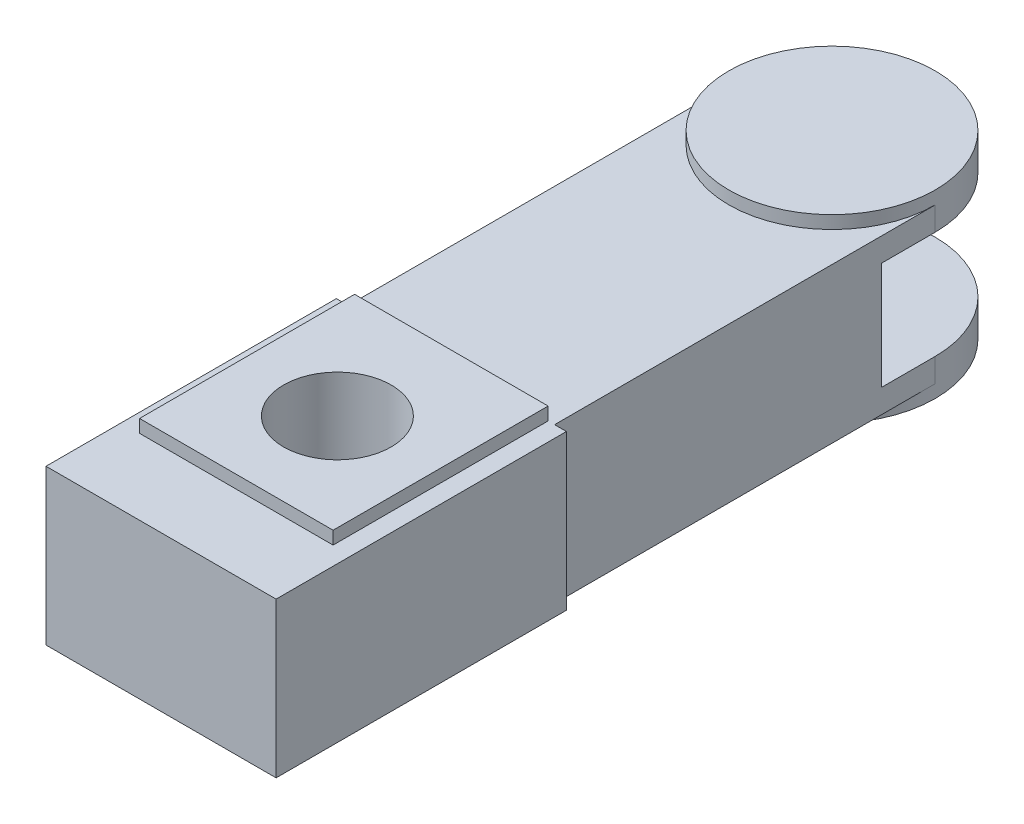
ISO-10303-21;
HEADER;
FILE_DESCRIPTION(('STEP AP214'),'2;1');
FILE_NAME('part.step','',(''),(''),'','','');
FILE_SCHEMA(('AUTOMOTIVE_DESIGN { 1 0 10303 214 1 1 1 1 }'));
ENDSEC;
DATA;
#1=APPLICATION_CONTEXT('core data for automotive mechanical design processes');
#2=APPLICATION_PROTOCOL_DEFINITION('international standard','automotive_design',2000,#1);
#3=PRODUCT_CONTEXT('',#1,'mechanical');
#4=PRODUCT('Part','Part','',(#3));
#5=PRODUCT_RELATED_PRODUCT_CATEGORY('part','',(#4));
#6=PRODUCT_DEFINITION_FORMATION('','',#4);
#7=PRODUCT_DEFINITION_CONTEXT('part definition',#1,'design');
#8=PRODUCT_DEFINITION('design','',#6,#7);
#9=PRODUCT_DEFINITION_SHAPE('','',#8);
#10=(LENGTH_UNIT() NAMED_UNIT(*) SI_UNIT(.MILLI.,.METRE.));
#11=(NAMED_UNIT(*) PLANE_ANGLE_UNIT() SI_UNIT($,.RADIAN.));
#12=(NAMED_UNIT(*) SI_UNIT($,.STERADIAN.) SOLID_ANGLE_UNIT());
#13=UNCERTAINTY_MEASURE_WITH_UNIT(LENGTH_MEASURE(1.E-05),#10,'distance_accuracy_value','');
#14=(GEOMETRIC_REPRESENTATION_CONTEXT(3) GLOBAL_UNCERTAINTY_ASSIGNED_CONTEXT((#13)) GLOBAL_UNIT_ASSIGNED_CONTEXT((#10,
#11,#12)) REPRESENTATION_CONTEXT('',''));
#15=CARTESIAN_POINT('',(0.,0.,0.));
#16=DIRECTION('',(0.,0.,1.));
#17=DIRECTION('',(1.,0.,0.));
#18=AXIS2_PLACEMENT_3D('',#15,#16,#17);
#19=CARTESIAN_POINT('',(0.,36.,-312.));
#20=DIRECTION('',(0.,-1.,0.));
#21=DIRECTION('',(0.,0.,-1.));
#22=AXIS2_PLACEMENT_3D('',#19,#20,#21);
#23=CYLINDRICAL_SURFACE('',#22,48.);
#24=CARTESIAN_POINT('',(0.,-42.,-312.));
#25=DIRECTION('',(0.,1.,0.));
#26=DIRECTION('',(0.,0.,1.));
#27=AXIS2_PLACEMENT_3D('',#24,#25,#26);
#28=CIRCLE('',#27,48.);
#29=CARTESIAN_POINT('',(0.,-42.,-264.));
#30=VERTEX_POINT('',#29);
#31=EDGE_CURVE('E259',#30,#30,#28,.T.);
#32=ORIENTED_EDGE('',*,*,#31,.T.);
#33=EDGE_LOOP('',(#32));
#34=FACE_BOUND('',#33,.T.);
#35=CARTESIAN_POINT('',(0.,-25.,-312.));
#36=DIRECTION('',(0.,1.,0.));
#37=DIRECTION('',(0.,0.,1.));
#38=AXIS2_PLACEMENT_3D('',#35,#36,#37);
#39=CIRCLE('',#38,48.);
#40=CARTESIAN_POINT('',(48.,-25.,-312.));
#41=VERTEX_POINT('',#40);
#42=CARTESIAN_POINT('',(-48.,-25.,-312.));
#43=VERTEX_POINT('',#42);
#44=EDGE_CURVE('E338',#41,#43,#39,.T.);
#45=ORIENTED_EDGE('',*,*,#44,.F.);
#46=DIRECTION('',(0.,-1.,0.));
#47=VECTOR('',#46,1.);
#48=CARTESIAN_POINT('',(48.,36.,-312.));
#49=LINE('',#48,#47);
#50=CARTESIAN_POINT('',(48.,-36.,-312.));
#51=VERTEX_POINT('',#50);
#52=EDGE_CURVE('E207',#41,#51,#49,.T.);
#53=ORIENTED_EDGE('',*,*,#52,.T.);
#54=CARTESIAN_POINT('',(0.,-36.,-312.));
#55=DIRECTION('',(0.,1.,0.));
#56=DIRECTION('',(0.,0.,1.));
#57=AXIS2_PLACEMENT_3D('',#54,#55,#56);
#58=CIRCLE('',#57,48.);
#59=CARTESIAN_POINT('',(-48.,-36.,-312.));
#60=VERTEX_POINT('',#59);
#61=EDGE_CURVE('E210',#51,#60,#58,.F.);
#62=ORIENTED_EDGE('',*,*,#61,.T.);
#63=DIRECTION('',(0.,-1.,0.));
#64=VECTOR('',#63,1.);
#65=CARTESIAN_POINT('',(-48.,36.,-312.));
#66=LINE('',#65,#64);
#67=EDGE_CURVE('E310',#43,#60,#66,.T.);
#68=ORIENTED_EDGE('',*,*,#67,.F.);
#69=EDGE_LOOP('',(#45,#53,#62,#68));
#70=FACE_BOUND('',#69,.T.);
#71=ADVANCED_FACE('F28',(#34,#70),#23,.T.);
#72=CARTESIAN_POINT('',(0.,36.,-312.));
#73=DIRECTION('',(0.,1.,0.));
#74=DIRECTION('',(0.,0.,1.));
#75=AXIS2_PLACEMENT_3D('',#72,#73,#74);
#76=PLANE('',#75);
#77=DIRECTION('',(0.,0.,-1.));
#78=VECTOR('',#77,1.);
#79=CARTESIAN_POINT('',(48.,36.,-135.));
#80=LINE('',#79,#78);
#81=CARTESIAN_POINT('',(48.,36.,-135.));
#82=VERTEX_POINT('',#81);
#83=CARTESIAN_POINT('',(48.,36.,-312.));
#84=VERTEX_POINT('',#83);
#85=EDGE_CURVE('E285',#82,#84,#80,.T.);
#86=ORIENTED_EDGE('',*,*,#85,.T.);
#87=CARTESIAN_POINT('',(0.,36.,-312.));
#88=DIRECTION('',(0.,1.,0.));
#89=DIRECTION('',(0.,0.,1.));
#90=AXIS2_PLACEMENT_3D('',#87,#88,#89);
#91=CIRCLE('',#90,48.);
#92=CARTESIAN_POINT('',(-48.,36.,-312.));
#93=VERTEX_POINT('',#92);
#94=EDGE_CURVE('E204',#84,#93,#91,.F.);
#95=ORIENTED_EDGE('',*,*,#94,.T.);
#96=DIRECTION('',(0.,0.,1.));
#97=VECTOR('',#96,1.);
#98=CARTESIAN_POINT('',(-48.,36.,-312.));
#99=LINE('',#98,#97);
#100=CARTESIAN_POINT('',(-48.,36.,-135.));
#101=VERTEX_POINT('',#100);
#102=EDGE_CURVE('E287',#93,#101,#99,.T.);
#103=ORIENTED_EDGE('',*,*,#102,.T.);
#104=DIRECTION('',(-1.,0.,0.));
#105=VECTOR('',#104,1.);
#106=CARTESIAN_POINT('',(-53.5,36.,-135.));
#107=LINE('',#106,#105);
#108=CARTESIAN_POINT('',(-53.5,36.,-135.));
#109=VERTEX_POINT('',#108);
#110=EDGE_CURVE('E289',#101,#109,#107,.T.);
#111=ORIENTED_EDGE('',*,*,#110,.T.);
#112=DIRECTION('',(0.,0.,1.));
#113=VECTOR('',#112,1.);
#114=CARTESIAN_POINT('',(-53.5,36.,0.));
#115=LINE('',#114,#113);
#116=CARTESIAN_POINT('',(-53.5,36.,0.));
#117=VERTEX_POINT('',#116);
#118=EDGE_CURVE('E291',#109,#117,#115,.T.);
#119=ORIENTED_EDGE('',*,*,#118,.T.);
#120=DIRECTION('',(1.,0.,0.));
#121=VECTOR('',#120,1.);
#122=CARTESIAN_POINT('',(-53.5,36.,0.));
#123=LINE('',#122,#121);
#124=CARTESIAN_POINT('',(53.5,36.,0.));
#125=VERTEX_POINT('',#124);
#126=EDGE_CURVE('E293',#117,#125,#123,.T.);
#127=ORIENTED_EDGE('',*,*,#126,.T.);
#128=DIRECTION('',(0.,0.,-1.));
#129=VECTOR('',#128,1.);
#130=CARTESIAN_POINT('',(53.5,36.,0.));
#131=LINE('',#130,#129);
#132=CARTESIAN_POINT('',(53.5,36.,-135.));
#133=VERTEX_POINT('',#132);
#134=EDGE_CURVE('E295',#125,#133,#131,.T.);
#135=ORIENTED_EDGE('',*,*,#134,.T.);
#136=DIRECTION('',(-1.,0.,0.));
#137=VECTOR('',#136,1.);
#138=CARTESIAN_POINT('',(53.5,36.,-135.));
#139=LINE('',#138,#137);
#140=EDGE_CURVE('E282',#133,#82,#139,.T.);
#141=ORIENTED_EDGE('',*,*,#140,.T.);
#142=EDGE_LOOP('',(#86,#95,#103,#111,#119,#127,#135,#141));
#143=FACE_BOUND('',#142,.T.);
#144=DIRECTION('',(-1.,0.,0.));
#145=VECTOR('',#144,1.);
#146=CARTESIAN_POINT('',(0.,36.,-35.));
#147=LINE('',#146,#145);
#148=CARTESIAN_POINT('',(45.,36.,-35.));
#149=VERTEX_POINT('',#148);
#150=CARTESIAN_POINT('',(-45.,36.,-35.));
#151=VERTEX_POINT('',#150);
#152=EDGE_CURVE('E253',#149,#151,#147,.T.);
#153=ORIENTED_EDGE('',*,*,#152,.T.);
#154=DIRECTION('',(0.,0.,-1.));
#155=VECTOR('',#154,1.);
#156=CARTESIAN_POINT('',(-45.,36.,-312.));
#157=LINE('',#156,#155);
#158=CARTESIAN_POINT('',(-45.,36.,-135.));
#159=VERTEX_POINT('',#158);
#160=EDGE_CURVE('E256',#151,#159,#157,.T.);
#161=ORIENTED_EDGE('',*,*,#160,.T.);
#162=DIRECTION('',(1.,0.,0.));
#163=VECTOR('',#162,1.);
#164=CARTESIAN_POINT('',(0.,36.,-135.));
#165=LINE('',#164,#163);
#166=CARTESIAN_POINT('',(45.,36.,-135.));
#167=VERTEX_POINT('',#166);
#168=EDGE_CURVE('E243',#159,#167,#165,.T.);
#169=ORIENTED_EDGE('',*,*,#168,.T.);
#170=DIRECTION('',(0.,0.,1.));
#171=VECTOR('',#170,1.);
#172=CARTESIAN_POINT('',(45.,36.,-312.));
#173=LINE('',#172,#171);
#174=EDGE_CURVE('E250',#167,#149,#173,.T.);
#175=ORIENTED_EDGE('',*,*,#174,.T.);
#176=EDGE_LOOP('',(#153,#161,#169,#175));
#177=FACE_BOUND('',#176,.T.);
#178=ADVANCED_FACE('F322',(#143,#177),#76,.T.);
#179=CARTESIAN_POINT('',(0.,-36.,-312.));
#180=DIRECTION('',(0.,1.,0.));
#181=DIRECTION('',(0.,0.,1.));
#182=AXIS2_PLACEMENT_3D('',#179,#180,#181);
#183=PLANE('',#182);
#184=ORIENTED_EDGE('',*,*,#61,.F.);
#185=DIRECTION('',(0.,0.,-1.));
#186=VECTOR('',#185,1.);
#187=CARTESIAN_POINT('',(48.,-36.,-135.));
#188=LINE('',#187,#186);
#189=CARTESIAN_POINT('',(48.,-36.,-135.));
#190=VERTEX_POINT('',#189);
#191=EDGE_CURVE('E269',#190,#51,#188,.T.);
#192=ORIENTED_EDGE('',*,*,#191,.F.);
#193=DIRECTION('',(-1.,0.,0.));
#194=VECTOR('',#193,1.);
#195=CARTESIAN_POINT('',(53.5,-36.,-135.));
#196=LINE('',#195,#194);
#197=CARTESIAN_POINT('',(53.5,-36.,-135.));
#198=VERTEX_POINT('',#197);
#199=EDGE_CURVE('E266',#198,#190,#196,.T.);
#200=ORIENTED_EDGE('',*,*,#199,.F.);
#201=DIRECTION('',(0.,0.,-1.));
#202=VECTOR('',#201,1.);
#203=CARTESIAN_POINT('',(53.5,-36.,0.));
#204=LINE('',#203,#202);
#205=CARTESIAN_POINT('',(53.5,-36.,0.));
#206=VERTEX_POINT('',#205);
#207=EDGE_CURVE('E280',#206,#198,#204,.T.);
#208=ORIENTED_EDGE('',*,*,#207,.F.);
#209=DIRECTION('',(1.,0.,0.));
#210=VECTOR('',#209,1.);
#211=CARTESIAN_POINT('',(-53.5,-36.,0.));
#212=LINE('',#211,#210);
#213=CARTESIAN_POINT('',(-53.5,-36.,0.));
#214=VERTEX_POINT('',#213);
#215=EDGE_CURVE('E278',#214,#206,#212,.T.);
#216=ORIENTED_EDGE('',*,*,#215,.F.);
#217=DIRECTION('',(0.,0.,1.));
#218=VECTOR('',#217,1.);
#219=CARTESIAN_POINT('',(-53.5,-36.,0.));
#220=LINE('',#219,#218);
#221=CARTESIAN_POINT('',(-53.5,-36.,-135.));
#222=VERTEX_POINT('',#221);
#223=EDGE_CURVE('E276',#222,#214,#220,.T.);
#224=ORIENTED_EDGE('',*,*,#223,.F.);
#225=DIRECTION('',(-1.,0.,0.));
#226=VECTOR('',#225,1.);
#227=CARTESIAN_POINT('',(-53.5,-36.,-135.));
#228=LINE('',#227,#226);
#229=CARTESIAN_POINT('',(-48.,-36.,-135.));
#230=VERTEX_POINT('',#229);
#231=EDGE_CURVE('E274',#230,#222,#228,.T.);
#232=ORIENTED_EDGE('',*,*,#231,.F.);
#233=DIRECTION('',(0.,0.,1.));
#234=VECTOR('',#233,1.);
#235=CARTESIAN_POINT('',(-48.,-36.,-312.));
#236=LINE('',#235,#234);
#237=EDGE_CURVE('E272',#60,#230,#236,.T.);
#238=ORIENTED_EDGE('',*,*,#237,.F.);
#239=EDGE_LOOP('',(#184,#192,#200,#208,#216,#224,#232,#238));
#240=FACE_BOUND('',#239,.T.);
#241=DIRECTION('',(0.,0.,-1.));
#242=VECTOR('',#241,1.);
#243=CARTESIAN_POINT('',(-45.,-36.,-312.));
#244=LINE('',#243,#242);
#245=CARTESIAN_POINT('',(-45.,-36.,-35.));
#246=VERTEX_POINT('',#245);
#247=CARTESIAN_POINT('',(-45.,-36.,-135.));
#248=VERTEX_POINT('',#247);
#249=EDGE_CURVE('E11',#246,#248,#244,.T.);
#250=ORIENTED_EDGE('',*,*,#249,.F.);
#251=DIRECTION('',(-1.,0.,0.));
#252=VECTOR('',#251,1.);
#253=CARTESIAN_POINT('',(0.,-36.,-35.));
#254=LINE('',#253,#252);
#255=CARTESIAN_POINT('',(45.,-36.,-35.));
#256=VERTEX_POINT('',#255);
#257=EDGE_CURVE('E36',#256,#246,#254,.T.);
#258=ORIENTED_EDGE('',*,*,#257,.F.);
#259=DIRECTION('',(0.,0.,1.));
#260=VECTOR('',#259,1.);
#261=CARTESIAN_POINT('',(45.,-36.,-312.));
#262=LINE('',#261,#260);
#263=CARTESIAN_POINT('',(45.,-36.,-135.));
#264=VERTEX_POINT('',#263);
#265=EDGE_CURVE('E221',#264,#256,#262,.T.);
#266=ORIENTED_EDGE('',*,*,#265,.F.);
#267=DIRECTION('',(1.,0.,0.));
#268=VECTOR('',#267,1.);
#269=CARTESIAN_POINT('',(0.,-36.,-135.));
#270=LINE('',#269,#268);
#271=EDGE_CURVE('E218',#248,#264,#270,.T.);
#272=ORIENTED_EDGE('',*,*,#271,.F.);
#273=EDGE_LOOP('',(#250,#258,#266,#272));
#274=FACE_BOUND('',#273,.T.);
#275=ADVANCED_FACE('F333',(#240,#274),#183,.F.);
#276=CARTESIAN_POINT('',(53.5,36.,-135.));
#277=DIRECTION('',(0.,0.,1.));
#278=DIRECTION('',(1.,0.,0.));
#279=AXIS2_PLACEMENT_3D('',#276,#277,#278);
#280=PLANE('',#279);
#281=ORIENTED_EDGE('',*,*,#199,.T.);
#282=DIRECTION('',(0.,-1.,0.));
#283=VECTOR('',#282,1.);
#284=CARTESIAN_POINT('',(48.,36.,-135.));
#285=LINE('',#284,#283);
#286=EDGE_CURVE('E206',#82,#190,#285,.T.);
#287=ORIENTED_EDGE('',*,*,#286,.F.);
#288=ORIENTED_EDGE('',*,*,#140,.F.);
#289=DIRECTION('',(0.,-1.,0.));
#290=VECTOR('',#289,1.);
#291=CARTESIAN_POINT('',(53.5,36.,-135.));
#292=LINE('',#291,#290);
#293=EDGE_CURVE('E297',#133,#198,#292,.T.);
#294=ORIENTED_EDGE('',*,*,#293,.T.);
#295=EDGE_LOOP('',(#281,#287,#288,#294));
#296=FACE_BOUND('',#295,.T.);
#297=ADVANCED_FACE('F30',(#296),#280,.F.);
#298=CARTESIAN_POINT('',(48.,36.,-135.));
#299=DIRECTION('',(-1.,0.,0.));
#300=DIRECTION('',(0.,0.,1.));
#301=AXIS2_PLACEMENT_3D('',#298,#299,#300);
#302=PLANE('',#301);
#303=ORIENTED_EDGE('',*,*,#52,.F.);
#304=DIRECTION('',(0.,0.,-1.));
#305=VECTOR('',#304,1.);
#306=CARTESIAN_POINT('',(48.,-25.,-312.));
#307=LINE('',#306,#305);
#308=CARTESIAN_POINT('',(48.,-25.,-287.));
#309=VERTEX_POINT('',#308);
#310=EDGE_CURVE('E339',#309,#41,#307,.T.);
#311=ORIENTED_EDGE('',*,*,#310,.F.);
#312=DIRECTION('',(0.,-1.,0.));
#313=VECTOR('',#312,1.);
#314=CARTESIAN_POINT('',(48.,25.,-287.));
#315=LINE('',#314,#313);
#316=CARTESIAN_POINT('',(48.,25.,-287.));
#317=VERTEX_POINT('',#316);
#318=EDGE_CURVE('E187',#317,#309,#315,.T.);
#319=ORIENTED_EDGE('',*,*,#318,.F.);
#320=DIRECTION('',(0.,0.,1.));
#321=VECTOR('',#320,1.);
#322=CARTESIAN_POINT('',(48.,25.,-312.));
#323=LINE('',#322,#321);
#324=CARTESIAN_POINT('',(48.,25.,-312.));
#325=VERTEX_POINT('',#324);
#326=EDGE_CURVE('E179',#325,#317,#323,.T.);
#327=ORIENTED_EDGE('',*,*,#326,.F.);
#328=EDGE_CURVE('E184',#84,#325,#49,.T.);
#329=ORIENTED_EDGE('',*,*,#328,.F.);
#330=ORIENTED_EDGE('',*,*,#85,.F.);
#331=ORIENTED_EDGE('',*,*,#286,.T.);
#332=ORIENTED_EDGE('',*,*,#191,.T.);
#333=EDGE_LOOP('',(#303,#311,#319,#327,#329,#330,#331,#332));
#334=FACE_BOUND('',#333,.T.);
#335=ADVANCED_FACE('F182',(#334),#302,.F.);
#336=ORIENTED_EDGE('',*,*,#328,.T.);
#337=CARTESIAN_POINT('',(0.,25.,-312.));
#338=DIRECTION('',(0.,1.,0.));
#339=DIRECTION('',(0.,0.,1.));
#340=AXIS2_PLACEMENT_3D('',#337,#338,#339);
#341=CIRCLE('',#340,48.);
#342=CARTESIAN_POINT('',(-48.,25.,-312.));
#343=VERTEX_POINT('',#342);
#344=EDGE_CURVE('E191',#325,#343,#341,.T.);
#345=ORIENTED_EDGE('',*,*,#344,.T.);
#346=EDGE_CURVE('E212',#93,#343,#66,.T.);
#347=ORIENTED_EDGE('',*,*,#346,.F.);
#348=ORIENTED_EDGE('',*,*,#94,.F.);
#349=EDGE_LOOP('',(#336,#345,#347,#348));
#350=FACE_BOUND('',#349,.T.);
#351=CARTESIAN_POINT('',(0.,42.,-312.));
#352=DIRECTION('',(0.,1.,0.));
#353=DIRECTION('',(0.,0.,1.));
#354=AXIS2_PLACEMENT_3D('',#351,#352,#353);
#355=CIRCLE('',#354,48.);
#356=CARTESIAN_POINT('',(0.,42.,-264.));
#357=VERTEX_POINT('',#356);
#358=EDGE_CURVE('E262',#357,#357,#355,.T.);
#359=ORIENTED_EDGE('',*,*,#358,.F.);
#360=EDGE_LOOP('',(#359));
#361=FACE_BOUND('',#360,.T.);
#362=ADVANCED_FACE('F202',(#350,#361),#23,.T.);
#363=CARTESIAN_POINT('',(-48.,36.,-312.));
#364=DIRECTION('',(1.,0.,0.));
#365=DIRECTION('',(0.,0.,-1.));
#366=AXIS2_PLACEMENT_3D('',#363,#364,#365);
#367=PLANE('',#366);
#368=DIRECTION('',(0.,-1.,0.));
#369=VECTOR('',#368,1.);
#370=CARTESIAN_POINT('',(-48.,36.,-287.));
#371=LINE('',#370,#369);
#372=CARTESIAN_POINT('',(-48.,25.,-287.));
#373=VERTEX_POINT('',#372);
#374=CARTESIAN_POINT('',(-48.,-25.,-287.));
#375=VERTEX_POINT('',#374);
#376=EDGE_CURVE('E355',#373,#375,#371,.T.);
#377=ORIENTED_EDGE('',*,*,#376,.T.);
#378=DIRECTION('',(0.,0.,-1.));
#379=VECTOR('',#378,1.);
#380=CARTESIAN_POINT('',(-48.,-25.,-312.));
#381=LINE('',#380,#379);
#382=EDGE_CURVE('E358',#375,#43,#381,.T.);
#383=ORIENTED_EDGE('',*,*,#382,.T.);
#384=ORIENTED_EDGE('',*,*,#67,.T.);
#385=ORIENTED_EDGE('',*,*,#237,.T.);
#386=DIRECTION('',(0.,-1.,0.));
#387=VECTOR('',#386,1.);
#388=CARTESIAN_POINT('',(-48.,36.,-135.));
#389=LINE('',#388,#387);
#390=EDGE_CURVE('E308',#101,#230,#389,.T.);
#391=ORIENTED_EDGE('',*,*,#390,.F.);
#392=ORIENTED_EDGE('',*,*,#102,.F.);
#393=ORIENTED_EDGE('',*,*,#346,.T.);
#394=DIRECTION('',(0.,0.,1.));
#395=VECTOR('',#394,1.);
#396=CARTESIAN_POINT('',(-48.,25.,-312.));
#397=LINE('',#396,#395);
#398=EDGE_CURVE('E195',#343,#373,#397,.T.);
#399=ORIENTED_EDGE('',*,*,#398,.T.);
#400=EDGE_LOOP('',(#377,#383,#384,#385,#391,#392,#393,#399));
#401=FACE_BOUND('',#400,.T.);
#402=ADVANCED_FACE('F320',(#401),#367,.F.);
#403=CARTESIAN_POINT('',(-53.5,36.,-135.));
#404=DIRECTION('',(0.,0.,1.));
#405=DIRECTION('',(1.,0.,0.));
#406=AXIS2_PLACEMENT_3D('',#403,#404,#405);
#407=PLANE('',#406);
#408=ORIENTED_EDGE('',*,*,#231,.T.);
#409=DIRECTION('',(0.,-1.,0.));
#410=VECTOR('',#409,1.);
#411=CARTESIAN_POINT('',(-53.5,36.,-135.));
#412=LINE('',#411,#410);
#413=EDGE_CURVE('E306',#109,#222,#412,.T.);
#414=ORIENTED_EDGE('',*,*,#413,.F.);
#415=ORIENTED_EDGE('',*,*,#110,.F.);
#416=ORIENTED_EDGE('',*,*,#390,.T.);
#417=EDGE_LOOP('',(#408,#414,#415,#416));
#418=FACE_BOUND('',#417,.T.);
#419=ADVANCED_FACE('F420',(#418),#407,.F.);
#420=CARTESIAN_POINT('',(-53.5,36.,0.));
#421=DIRECTION('',(1.,0.,0.));
#422=DIRECTION('',(0.,0.,-1.));
#423=AXIS2_PLACEMENT_3D('',#420,#421,#422);
#424=PLANE('',#423);
#425=ORIENTED_EDGE('',*,*,#223,.T.);
#426=DIRECTION('',(0.,-1.,0.));
#427=VECTOR('',#426,1.);
#428=CARTESIAN_POINT('',(-53.5,36.,0.));
#429=LINE('',#428,#427);
#430=EDGE_CURVE('E303',#117,#214,#429,.T.);
#431=ORIENTED_EDGE('',*,*,#430,.F.);
#432=ORIENTED_EDGE('',*,*,#118,.F.);
#433=ORIENTED_EDGE('',*,*,#413,.T.);
#434=EDGE_LOOP('',(#425,#431,#432,#433));
#435=FACE_BOUND('',#434,.T.);
#436=ADVANCED_FACE('F441',(#435),#424,.F.);
#437=CARTESIAN_POINT('',(-53.5,36.,0.));
#438=DIRECTION('',(0.,0.,-1.));
#439=DIRECTION('',(-1.,0.,0.));
#440=AXIS2_PLACEMENT_3D('',#437,#438,#439);
#441=PLANE('',#440);
#442=ORIENTED_EDGE('',*,*,#215,.T.);
#443=DIRECTION('',(0.,-1.,0.));
#444=VECTOR('',#443,1.);
#445=CARTESIAN_POINT('',(53.5,36.,0.));
#446=LINE('',#445,#444);
#447=EDGE_CURVE('E300',#125,#206,#446,.T.);
#448=ORIENTED_EDGE('',*,*,#447,.F.);
#449=ORIENTED_EDGE('',*,*,#126,.F.);
#450=ORIENTED_EDGE('',*,*,#430,.T.);
#451=EDGE_LOOP('',(#442,#448,#449,#450));
#452=FACE_BOUND('',#451,.T.);
#453=ADVANCED_FACE('F437',(#452),#441,.F.);
#454=CARTESIAN_POINT('',(53.5,36.,0.));
#455=DIRECTION('',(-1.,0.,0.));
#456=DIRECTION('',(0.,0.,1.));
#457=AXIS2_PLACEMENT_3D('',#454,#455,#456);
#458=PLANE('',#457);
#459=ORIENTED_EDGE('',*,*,#207,.T.);
#460=ORIENTED_EDGE('',*,*,#293,.F.);
#461=ORIENTED_EDGE('',*,*,#134,.F.);
#462=ORIENTED_EDGE('',*,*,#447,.T.);
#463=EDGE_LOOP('',(#459,#460,#461,#462));
#464=FACE_BOUND('',#463,.T.);
#465=ADVANCED_FACE('F434',(#464),#458,.F.);
#466=CARTESIAN_POINT('',(0.,-42.,-312.));
#467=DIRECTION('',(0.,1.,0.));
#468=DIRECTION('',(0.,0.,1.));
#469=AXIS2_PLACEMENT_3D('',#466,#467,#468);
#470=PLANE('',#469);
#471=ORIENTED_EDGE('',*,*,#31,.F.);
#472=EDGE_LOOP('',(#471));
#473=FACE_BOUND('',#472,.T.);
#474=ADVANCED_FACE('F401',(#473),#470,.F.);
#475=CARTESIAN_POINT('',(0.,42.,-312.));
#476=DIRECTION('',(0.,1.,0.));
#477=DIRECTION('',(0.,0.,1.));
#478=AXIS2_PLACEMENT_3D('',#475,#476,#477);
#479=PLANE('',#478);
#480=ORIENTED_EDGE('',*,*,#358,.T.);
#481=EDGE_LOOP('',(#480));
#482=FACE_BOUND('',#481,.T.);
#483=ADVANCED_FACE('F393',(#482),#479,.T.);
#484=CARTESIAN_POINT('',(-45.,-42.,-35.));
#485=DIRECTION('',(0.,1.,0.));
#486=DIRECTION('',(0.,0.,1.));
#487=AXIS2_PLACEMENT_3D('',#484,#485,#486);
#488=PLANE('',#487);
#489=DIRECTION('',(0.,0.,1.));
#490=VECTOR('',#489,1.);
#491=CARTESIAN_POINT('',(-45.,-42.,-135.));
#492=LINE('',#491,#490);
#493=CARTESIAN_POINT('',(-45.,-42.,-135.));
#494=VERTEX_POINT('',#493);
#495=CARTESIAN_POINT('',(-45.,-42.,-35.));
#496=VERTEX_POINT('',#495);
#497=EDGE_CURVE('E238',#494,#496,#492,.T.);
#498=ORIENTED_EDGE('',*,*,#497,.F.);
#499=DIRECTION('',(-1.,0.,0.));
#500=VECTOR('',#499,1.);
#501=CARTESIAN_POINT('',(-45.,-42.,-135.));
#502=LINE('',#501,#500);
#503=CARTESIAN_POINT('',(45.,-42.,-135.));
#504=VERTEX_POINT('',#503);
#505=EDGE_CURVE('E367',#504,#494,#502,.T.);
#506=ORIENTED_EDGE('',*,*,#505,.F.);
#507=DIRECTION('',(0.,0.,-1.));
#508=VECTOR('',#507,1.);
#509=CARTESIAN_POINT('',(45.,-42.,-135.));
#510=LINE('',#509,#508);
#511=CARTESIAN_POINT('',(45.,-42.,-35.));
#512=VERTEX_POINT('',#511);
#513=EDGE_CURVE('E364',#512,#504,#510,.T.);
#514=ORIENTED_EDGE('',*,*,#513,.F.);
#515=DIRECTION('',(1.,0.,0.));
#516=VECTOR('',#515,1.);
#517=CARTESIAN_POINT('',(-45.,-42.,-35.));
#518=LINE('',#517,#516);
#519=EDGE_CURVE('E362',#496,#512,#518,.T.);
#520=ORIENTED_EDGE('',*,*,#519,.F.);
#521=EDGE_LOOP('',(#498,#506,#514,#520));
#522=FACE_BOUND('',#521,.T.);
#523=ADVANCED_FACE('F391',(#522),#488,.F.);
#524=CARTESIAN_POINT('',(-45.,42.,-135.));
#525=DIRECTION('',(0.,0.,1.));
#526=DIRECTION('',(1.,0.,0.));
#527=AXIS2_PLACEMENT_3D('',#524,#525,#526);
#528=PLANE('',#527);
#529=DIRECTION('',(0.,-1.,0.));
#530=VECTOR('',#529,1.);
#531=CARTESIAN_POINT('',(-45.,42.,-135.));
#532=LINE('',#531,#530);
#533=EDGE_CURVE('E379',#248,#494,#532,.T.);
#534=ORIENTED_EDGE('',*,*,#533,.F.);
#535=ORIENTED_EDGE('',*,*,#271,.T.);
#536=DIRECTION('',(0.,-1.,0.));
#537=VECTOR('',#536,1.);
#538=CARTESIAN_POINT('',(45.,42.,-135.));
#539=LINE('',#538,#537);
#540=EDGE_CURVE('E382',#264,#504,#539,.T.);
#541=ORIENTED_EDGE('',*,*,#540,.T.);
#542=ORIENTED_EDGE('',*,*,#505,.T.);
#543=EDGE_LOOP('',(#534,#535,#541,#542));
#544=FACE_BOUND('',#543,.T.);
#545=ADVANCED_FACE('F385',(#544),#528,.F.);
#546=CARTESIAN_POINT('',(45.,42.,-135.));
#547=DIRECTION('',(-1.,0.,0.));
#548=DIRECTION('',(0.,0.,1.));
#549=AXIS2_PLACEMENT_3D('',#546,#547,#548);
#550=PLANE('',#549);
#551=ORIENTED_EDGE('',*,*,#540,.F.);
#552=ORIENTED_EDGE('',*,*,#265,.T.);
#553=DIRECTION('',(0.,-1.,0.));
#554=VECTOR('',#553,1.);
#555=CARTESIAN_POINT('',(45.,42.,-35.));
#556=LINE('',#555,#554);
#557=EDGE_CURVE('E231',#256,#512,#556,.T.);
#558=ORIENTED_EDGE('',*,*,#557,.T.);
#559=ORIENTED_EDGE('',*,*,#513,.T.);
#560=EDGE_LOOP('',(#551,#552,#558,#559));
#561=FACE_BOUND('',#560,.T.);
#562=ADVANCED_FACE('F389',(#561),#550,.F.);
#563=CARTESIAN_POINT('',(-45.,42.,-35.));
#564=DIRECTION('',(0.,0.,-1.));
#565=DIRECTION('',(-1.,0.,0.));
#566=AXIS2_PLACEMENT_3D('',#563,#564,#565);
#567=PLANE('',#566);
#568=ORIENTED_EDGE('',*,*,#557,.F.);
#569=ORIENTED_EDGE('',*,*,#257,.T.);
#570=DIRECTION('',(0.,-1.,0.));
#571=VECTOR('',#570,1.);
#572=CARTESIAN_POINT('',(-45.,42.,-35.));
#573=LINE('',#572,#571);
#574=EDGE_CURVE('E229',#246,#496,#573,.T.);
#575=ORIENTED_EDGE('',*,*,#574,.T.);
#576=ORIENTED_EDGE('',*,*,#519,.T.);
#577=EDGE_LOOP('',(#568,#569,#575,#576));
#578=FACE_BOUND('',#577,.T.);
#579=ADVANCED_FACE('F227',(#578),#567,.F.);
#580=CARTESIAN_POINT('',(-45.,42.,-135.));
#581=DIRECTION('',(1.,0.,0.));
#582=DIRECTION('',(0.,0.,-1.));
#583=AXIS2_PLACEMENT_3D('',#580,#581,#582);
#584=PLANE('',#583);
#585=ORIENTED_EDGE('',*,*,#574,.F.);
#586=ORIENTED_EDGE('',*,*,#249,.T.);
#587=ORIENTED_EDGE('',*,*,#533,.T.);
#588=ORIENTED_EDGE('',*,*,#497,.T.);
#589=EDGE_LOOP('',(#585,#586,#587,#588));
#590=FACE_BOUND('',#589,.T.);
#591=ADVANCED_FACE('F235',(#590),#584,.F.);
#592=ORIENTED_EDGE('',*,*,#160,.F.);
#593=CARTESIAN_POINT('',(-45.,42.,-35.));
#594=VERTEX_POINT('',#593);
#595=EDGE_CURVE('E239',#594,#151,#573,.T.);
#596=ORIENTED_EDGE('',*,*,#595,.F.);
#597=DIRECTION('',(0.,0.,1.));
#598=VECTOR('',#597,1.);
#599=CARTESIAN_POINT('',(-45.,42.,-135.));
#600=LINE('',#599,#598);
#601=CARTESIAN_POINT('',(-45.,42.,-135.));
#602=VERTEX_POINT('',#601);
#603=EDGE_CURVE('E370',#602,#594,#600,.T.);
#604=ORIENTED_EDGE('',*,*,#603,.F.);
#605=EDGE_CURVE('E380',#602,#159,#532,.T.);
#606=ORIENTED_EDGE('',*,*,#605,.T.);
#607=EDGE_LOOP('',(#592,#596,#604,#606));
#608=FACE_BOUND('',#607,.T.);
#609=ADVANCED_FACE('F514',(#608),#584,.F.);
#610=ORIENTED_EDGE('',*,*,#152,.F.);
#611=CARTESIAN_POINT('',(45.,42.,-35.));
#612=VERTEX_POINT('',#611);
#613=EDGE_CURVE('E240',#612,#149,#556,.T.);
#614=ORIENTED_EDGE('',*,*,#613,.F.);
#615=DIRECTION('',(1.,0.,0.));
#616=VECTOR('',#615,1.);
#617=CARTESIAN_POINT('',(-45.,42.,-35.));
#618=LINE('',#617,#616);
#619=EDGE_CURVE('E373',#594,#612,#618,.T.);
#620=ORIENTED_EDGE('',*,*,#619,.F.);
#621=ORIENTED_EDGE('',*,*,#595,.T.);
#622=EDGE_LOOP('',(#610,#614,#620,#621));
#623=FACE_BOUND('',#622,.T.);
#624=ADVANCED_FACE('F508',(#623),#567,.F.);
#625=ORIENTED_EDGE('',*,*,#174,.F.);
#626=CARTESIAN_POINT('',(45.,42.,-135.));
#627=VERTEX_POINT('',#626);
#628=EDGE_CURVE('E51',#627,#167,#539,.T.);
#629=ORIENTED_EDGE('',*,*,#628,.F.);
#630=DIRECTION('',(0.,0.,-1.));
#631=VECTOR('',#630,1.);
#632=CARTESIAN_POINT('',(45.,42.,-135.));
#633=LINE('',#632,#631);
#634=EDGE_CURVE('E375',#612,#627,#633,.T.);
#635=ORIENTED_EDGE('',*,*,#634,.F.);
#636=ORIENTED_EDGE('',*,*,#613,.T.);
#637=EDGE_LOOP('',(#625,#629,#635,#636));
#638=FACE_BOUND('',#637,.T.);
#639=ADVANCED_FACE('F501',(#638),#550,.F.);
#640=ORIENTED_EDGE('',*,*,#168,.F.);
#641=ORIENTED_EDGE('',*,*,#605,.F.);
#642=DIRECTION('',(-1.,0.,0.));
#643=VECTOR('',#642,1.);
#644=CARTESIAN_POINT('',(-45.,42.,-135.));
#645=LINE('',#644,#643);
#646=EDGE_CURVE('E377',#627,#602,#645,.T.);
#647=ORIENTED_EDGE('',*,*,#646,.F.);
#648=ORIENTED_EDGE('',*,*,#628,.T.);
#649=EDGE_LOOP('',(#640,#641,#647,#648));
#650=FACE_BOUND('',#649,.T.);
#651=ADVANCED_FACE('F400',(#650),#528,.F.);
#652=CARTESIAN_POINT('',(-45.,42.,-35.));
#653=DIRECTION('',(0.,1.,0.));
#654=DIRECTION('',(0.,0.,1.));
#655=AXIS2_PLACEMENT_3D('',#652,#653,#654);
#656=PLANE('',#655);
#657=CARTESIAN_POINT('',(0.,42.,-82.));
#658=DIRECTION('',(0.,1.,0.));
#659=DIRECTION('',(0.,0.,1.));
#660=AXIS2_PLACEMENT_3D('',#657,#658,#659);
#661=CIRCLE('',#660,25.);
#662=CARTESIAN_POINT('',(0.,42.,-57.));
#663=VERTEX_POINT('',#662);
#664=EDGE_CURVE('E608',#663,#663,#661,.T.);
#665=ORIENTED_EDGE('',*,*,#664,.F.);
#666=EDGE_LOOP('',(#665));
#667=FACE_BOUND('',#666,.T.);
#668=ORIENTED_EDGE('',*,*,#603,.T.);
#669=ORIENTED_EDGE('',*,*,#619,.T.);
#670=ORIENTED_EDGE('',*,*,#634,.T.);
#671=ORIENTED_EDGE('',*,*,#646,.T.);
#672=EDGE_LOOP('',(#668,#669,#670,#671));
#673=FACE_BOUND('',#672,.T.);
#674=ADVANCED_FACE('F538',(#667,#673),#656,.T.);
#675=CARTESIAN_POINT('',(0.,-25.,-312.));
#676=DIRECTION('',(0.,1.,0.));
#677=DIRECTION('',(0.,0.,1.));
#678=AXIS2_PLACEMENT_3D('',#675,#676,#677);
#679=CYLINDRICAL_SURFACE('',#678,48.);
#680=CARTESIAN_POINT('',(-40.9756024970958,25.,-287.));
#681=VERTEX_POINT('',#680);
#682=CARTESIAN_POINT('',(40.9756024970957,25.,-287.));
#683=VERTEX_POINT('',#682);
#684=EDGE_CURVE('E200',#681,#683,#341,.T.);
#685=ORIENTED_EDGE('',*,*,#684,.T.);
#686=DIRECTION('',(0.,1.,0.));
#687=VECTOR('',#686,1.);
#688=CARTESIAN_POINT('',(40.9756024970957,-25.,-287.));
#689=LINE('',#688,#687);
#690=CARTESIAN_POINT('',(40.9756024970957,-25.,-287.));
#691=VERTEX_POINT('',#690);
#692=EDGE_CURVE('E352',#683,#691,#689,.F.);
#693=ORIENTED_EDGE('',*,*,#692,.T.);
#694=CARTESIAN_POINT('',(-40.9756024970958,-25.,-287.));
#695=VERTEX_POINT('',#694);
#696=EDGE_CURVE('E199',#695,#691,#39,.T.);
#697=ORIENTED_EDGE('',*,*,#696,.F.);
#698=DIRECTION('',(0.,1.,0.));
#699=VECTOR('',#698,1.);
#700=CARTESIAN_POINT('',(-40.9756024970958,-25.,-287.));
#701=LINE('',#700,#699);
#702=EDGE_CURVE('E349',#695,#681,#701,.T.);
#703=ORIENTED_EDGE('',*,*,#702,.T.);
#704=EDGE_LOOP('',(#685,#693,#697,#703));
#705=FACE_BOUND('',#704,.T.);
#706=ADVANCED_FACE('F544',(#705),#679,.F.);
#707=CARTESIAN_POINT('',(0.,-25.,-312.));
#708=DIRECTION('',(0.,1.,0.));
#709=DIRECTION('',(0.,0.,1.));
#710=AXIS2_PLACEMENT_3D('',#707,#708,#709);
#711=PLANE('',#710);
#712=ORIENTED_EDGE('',*,*,#696,.T.);
#713=DIRECTION('',(1.,0.,0.));
#714=VECTOR('',#713,1.);
#715=CARTESIAN_POINT('',(-53.5,-25.,-287.));
#716=LINE('',#715,#714);
#717=EDGE_CURVE('E346',#691,#309,#716,.T.);
#718=ORIENTED_EDGE('',*,*,#717,.T.);
#719=ORIENTED_EDGE('',*,*,#310,.T.);
#720=ORIENTED_EDGE('',*,*,#44,.T.);
#721=ORIENTED_EDGE('',*,*,#382,.F.);
#722=EDGE_CURVE('E347',#375,#695,#716,.T.);
#723=ORIENTED_EDGE('',*,*,#722,.T.);
#724=EDGE_LOOP('',(#712,#718,#719,#720,#721,#723));
#725=FACE_BOUND('',#724,.T.);
#726=ADVANCED_FACE('F558',(#725),#711,.T.);
#727=CARTESIAN_POINT('',(0.,25.,-312.));
#728=DIRECTION('',(0.,1.,0.));
#729=DIRECTION('',(0.,0.,1.));
#730=AXIS2_PLACEMENT_3D('',#727,#728,#729);
#731=PLANE('',#730);
#732=ORIENTED_EDGE('',*,*,#684,.F.);
#733=DIRECTION('',(1.,0.,0.));
#734=VECTOR('',#733,1.);
#735=CARTESIAN_POINT('',(-53.5,25.,-287.));
#736=LINE('',#735,#734);
#737=EDGE_CURVE('E342',#373,#681,#736,.T.);
#738=ORIENTED_EDGE('',*,*,#737,.F.);
#739=ORIENTED_EDGE('',*,*,#398,.F.);
#740=ORIENTED_EDGE('',*,*,#344,.F.);
#741=ORIENTED_EDGE('',*,*,#326,.T.);
#742=EDGE_CURVE('E43',#683,#317,#736,.T.);
#743=ORIENTED_EDGE('',*,*,#742,.F.);
#744=EDGE_LOOP('',(#732,#738,#739,#740,#741,#743));
#745=FACE_BOUND('',#744,.T.);
#746=ADVANCED_FACE('F192',(#745),#731,.F.);
#747=CARTESIAN_POINT('',(-53.5,25.,-287.));
#748=DIRECTION('',(0.,0.,1.));
#749=DIRECTION('',(1.,0.,0.));
#750=AXIS2_PLACEMENT_3D('',#747,#748,#749);
#751=PLANE('',#750);
#752=ORIENTED_EDGE('',*,*,#742,.T.);
#753=ORIENTED_EDGE('',*,*,#318,.T.);
#754=ORIENTED_EDGE('',*,*,#717,.F.);
#755=ORIENTED_EDGE('',*,*,#692,.F.);
#756=EDGE_LOOP('',(#752,#753,#754,#755));
#757=FACE_BOUND('',#756,.T.);
#758=ADVANCED_FACE('F573',(#757),#751,.F.);
#759=ORIENTED_EDGE('',*,*,#737,.T.);
#760=ORIENTED_EDGE('',*,*,#702,.F.);
#761=ORIENTED_EDGE('',*,*,#722,.F.);
#762=ORIENTED_EDGE('',*,*,#376,.F.);
#763=EDGE_LOOP('',(#759,#760,#761,#762));
#764=FACE_BOUND('',#763,.T.);
#765=ADVANCED_FACE('F583',(#764),#751,.F.);
#766=CARTESIAN_POINT('',(0.,-8.,-82.));
#767=DIRECTION('',(0.,1.,0.));
#768=DIRECTION('',(0.,0.,1.));
#769=AXIS2_PLACEMENT_3D('',#766,#767,#768);
#770=CYLINDRICAL_SURFACE('',#769,25.);
#771=CARTESIAN_POINT('',(0.,-8.,-82.));
#772=DIRECTION('',(0.,1.,0.));
#773=DIRECTION('',(0.,0.,1.));
#774=AXIS2_PLACEMENT_3D('',#771,#772,#773);
#775=CIRCLE('',#774,25.);
#776=CARTESIAN_POINT('',(0.,-8.,-57.));
#777=VERTEX_POINT('',#776);
#778=EDGE_CURVE('E188',#777,#777,#775,.T.);
#779=ORIENTED_EDGE('',*,*,#778,.F.);
#780=EDGE_LOOP('',(#779));
#781=FACE_BOUND('',#780,.T.);
#782=ORIENTED_EDGE('',*,*,#664,.T.);
#783=EDGE_LOOP('',(#782));
#784=FACE_BOUND('',#783,.T.);
#785=ADVANCED_FACE('F590',(#781,#784),#770,.F.);
#786=CARTESIAN_POINT('',(0.,-8.,-82.));
#787=DIRECTION('',(0.,1.,0.));
#788=DIRECTION('',(0.,0.,1.));
#789=AXIS2_PLACEMENT_3D('',#786,#787,#788);
#790=PLANE('',#789);
#791=ORIENTED_EDGE('',*,*,#778,.T.);
#792=EDGE_LOOP('',(#791));
#793=FACE_BOUND('',#792,.T.);
#794=ADVANCED_FACE('F596',(#793),#790,.T.);
#795=CLOSED_SHELL('',(#71,#178,#275,#297,#335,#362,#402,#419,#436,#453,#465,#474,#483,#523,#545,
#562,#579,#591,#609,#624,#639,#651,#674,#706,#726,#746,#758,#765,#785,#794));
#796=MANIFOLD_SOLID_BREP('B2',#795);
#797=ADVANCED_BREP_SHAPE_REPRESENTATION('',(#18,#796),#14);
#798=SHAPE_DEFINITION_REPRESENTATION(#9,#797);
ENDSEC;
END-ISO-10303-21;
